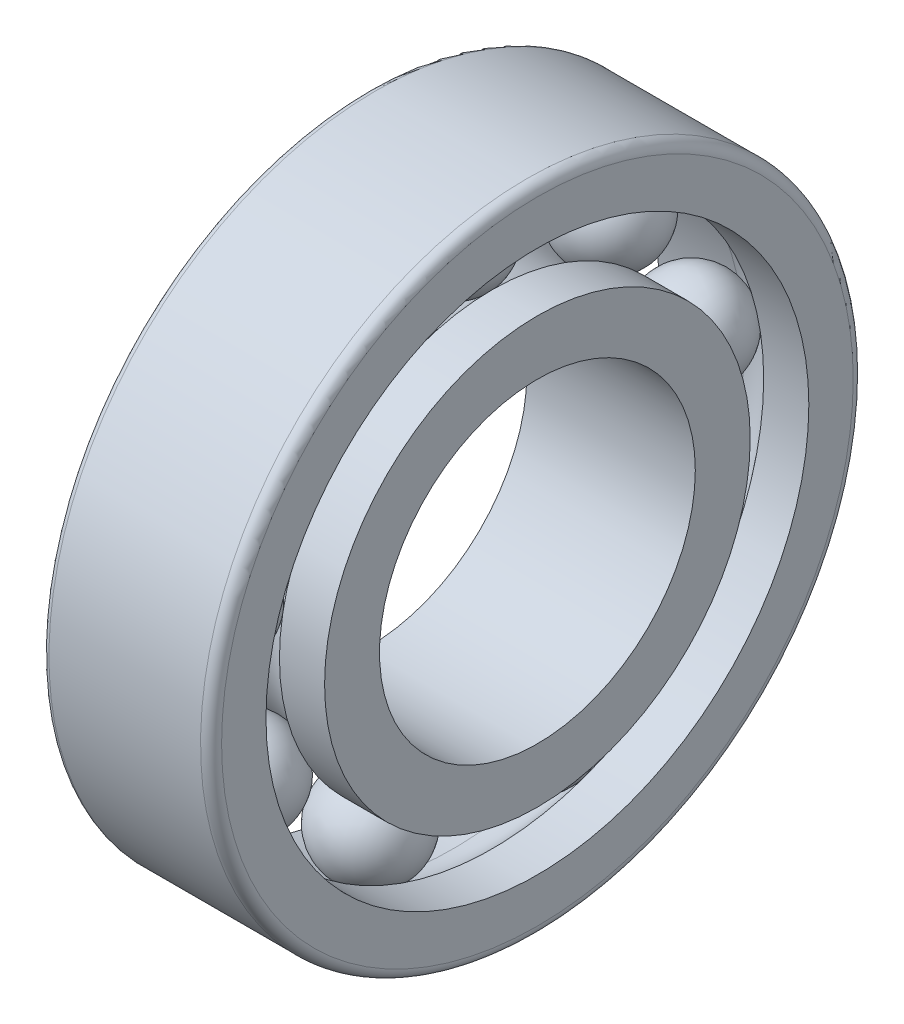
ISO-10303-21;
HEADER;
FILE_DESCRIPTION(('STEP AP214'),'2;1');
FILE_NAME('part.step','',(''),(''),'','','');
FILE_SCHEMA(('AUTOMOTIVE_DESIGN { 1 0 10303 214 1 1 1 1 }'));
ENDSEC;
DATA;
#1=APPLICATION_CONTEXT('core data for automotive mechanical design processes');
#2=APPLICATION_PROTOCOL_DEFINITION('international standard','automotive_design',2000,#1);
#3=PRODUCT_CONTEXT('',#1,'mechanical');
#4=PRODUCT('Part','Part','',(#3));
#5=PRODUCT_RELATED_PRODUCT_CATEGORY('part','',(#4));
#6=PRODUCT_DEFINITION_FORMATION('','',#4);
#7=PRODUCT_DEFINITION_CONTEXT('part definition',#1,'design');
#8=PRODUCT_DEFINITION('design','',#6,#7);
#9=PRODUCT_DEFINITION_SHAPE('','',#8);
#10=(LENGTH_UNIT() NAMED_UNIT(*) SI_UNIT(.MILLI.,.METRE.));
#11=(NAMED_UNIT(*) PLANE_ANGLE_UNIT() SI_UNIT($,.RADIAN.));
#12=(NAMED_UNIT(*) SI_UNIT($,.STERADIAN.) SOLID_ANGLE_UNIT());
#13=UNCERTAINTY_MEASURE_WITH_UNIT(LENGTH_MEASURE(1.E-05),#10,'distance_accuracy_value','');
#14=(GEOMETRIC_REPRESENTATION_CONTEXT(3) GLOBAL_UNCERTAINTY_ASSIGNED_CONTEXT((#13)) GLOBAL_UNIT_ASSIGNED_CONTEXT((#10,
#11,#12)) REPRESENTATION_CONTEXT('',''));
#15=CARTESIAN_POINT('',(0.,0.,0.));
#16=DIRECTION('',(0.,0.,1.));
#17=DIRECTION('',(1.,0.,0.));
#18=AXIS2_PLACEMENT_3D('',#15,#16,#17);
#19=CARTESIAN_POINT('',(8.,-11.5,19.9185842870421));
#20=DIRECTION('',(1.,0.,0.));
#21=DIRECTION('',(0.,-0.5,0.866025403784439));
#22=AXIS2_PLACEMENT_3D('',#19,#20,#21);
#23=SPHERICAL_SURFACE('',#22,4.64);
#24=CARTESIAN_POINT('',(3.36,-11.5,19.9185842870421));
#25=VERTEX_POINT('',#24);
#26=VERTEX_LOOP('',#25);
#27=FACE_BOUND('',#26,.T.);
#28=CARTESIAN_POINT('',(12.64,-11.5,19.9185842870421));
#29=VERTEX_POINT('',#28);
#30=VERTEX_LOOP('',#29);
#31=FACE_BOUND('',#30,.T.);
#32=ADVANCED_FACE('P0_F15',(#27,#31),#23,.T.);
#33=OPEN_SHELL('',(#32));
#34=SHELL_BASED_SURFACE_MODEL('P0_B1',(#33));
#35=CARTESIAN_POINT('',(8.,0.,0.));
#36=DIRECTION('',(1.,0.,0.));
#37=DIRECTION('',(0.,1.,0.));
#38=AXIS2_PLACEMENT_3D('',#35,#36,#37);
#39=TOROIDAL_SURFACE('',#38,23.,4.64);
#40=CARTESIAN_POINT('',(8.,0.,0.));
#41=DIRECTION('',(1.,0.,0.));
#42=DIRECTION('',(0.,0.,-1.));
#43=AXIS2_PLACEMENT_3D('',#40,#41,#42);
#44=CIRCLE('',#43,27.64);
#45=CARTESIAN_POINT('',(8.,0.,-27.64));
#46=VERTEX_POINT('',#45);
#47=EDGE_CURVE('P1_E112',#46,#46,#44,.T.);
#48=ORIENTED_EDGE('',*,*,#47,.F.);
#49=EDGE_LOOP('',(#48));
#50=FACE_BOUND('',#49,.T.);
#51=CARTESIAN_POINT('',(11.712,0.,0.));
#52=DIRECTION('',(1.,0.,0.));
#53=DIRECTION('',(0.,0.,-1.));
#54=AXIS2_PLACEMENT_3D('',#51,#52,#53);
#55=CIRCLE('',#54,25.784);
#56=CARTESIAN_POINT('',(11.712,0.,-25.784));
#57=VERTEX_POINT('',#56);
#58=EDGE_CURVE('P1_E115',#57,#57,#55,.F.);
#59=ORIENTED_EDGE('',*,*,#58,.F.);
#60=EDGE_LOOP('',(#59));
#61=FACE_BOUND('',#60,.T.);
#62=ADVANCED_FACE('P1_F14',(#50,#61),#39,.F.);
#63=CARTESIAN_POINT('',(13.856,0.,0.));
#64=DIRECTION('',(1.,0.,0.));
#65=DIRECTION('',(0.,0.,-1.));
#66=AXIS2_PLACEMENT_3D('',#63,#64,#65);
#67=CYLINDRICAL_SURFACE('',#66,25.784);
#68=CARTESIAN_POINT('',(16.,0.,0.));
#69=DIRECTION('',(1.,0.,0.));
#70=DIRECTION('',(0.,0.,-1.));
#71=AXIS2_PLACEMENT_3D('',#68,#69,#70);
#72=CIRCLE('',#71,25.784);
#73=CARTESIAN_POINT('',(16.,0.,-25.784));
#74=VERTEX_POINT('',#73);
#75=EDGE_CURVE('P1_E18',#74,#74,#72,.F.);
#76=ORIENTED_EDGE('',*,*,#75,.F.);
#77=EDGE_LOOP('',(#76));
#78=FACE_BOUND('',#77,.T.);
#79=ORIENTED_EDGE('',*,*,#58,.T.);
#80=EDGE_LOOP('',(#79));
#81=FACE_BOUND('',#80,.T.);
#82=ADVANCED_FACE('P1_F84',(#78,#81),#67,.F.);
#83=CARTESIAN_POINT('',(4.,0.,0.));
#84=DIRECTION('',(1.,0.,0.));
#85=DIRECTION('',(0.,0.,-1.));
#86=AXIS2_PLACEMENT_3D('',#83,#84,#85);
#87=CYLINDRICAL_SURFACE('',#86,27.64);
#88=ORIENTED_EDGE('',*,*,#47,.T.);
#89=EDGE_LOOP('',(#88));
#90=FACE_BOUND('',#89,.T.);
#91=CARTESIAN_POINT('',(0.,0.,0.));
#92=DIRECTION('',(1.,0.,0.));
#93=DIRECTION('',(0.,0.,-1.));
#94=AXIS2_PLACEMENT_3D('',#91,#92,#93);
#95=CIRCLE('',#94,27.64);
#96=CARTESIAN_POINT('',(0.,0.,-27.64));
#97=VERTEX_POINT('',#96);
#98=EDGE_CURVE('P1_E107',#97,#97,#95,.T.);
#99=ORIENTED_EDGE('',*,*,#98,.F.);
#100=EDGE_LOOP('',(#99));
#101=FACE_BOUND('',#100,.T.);
#102=ADVANCED_FACE('P1_F81',(#90,#101),#87,.F.);
#103=CARTESIAN_POINT('',(16.,28.392,0.));
#104=DIRECTION('',(1.,0.,0.));
#105=DIRECTION('',(0.,0.,-1.));
#106=AXIS2_PLACEMENT_3D('',#103,#104,#105);
#107=PLANE('',#106);
#108=CARTESIAN_POINT('',(16.,0.,0.));
#109=DIRECTION('',(-1.,0.,0.));
#110=DIRECTION('',(0.,1.,0.));
#111=AXIS2_PLACEMENT_3D('',#108,#109,#110);
#112=CIRCLE('',#111,30.);
#113=CARTESIAN_POINT('',(16.,30.,0.));
#114=VERTEX_POINT('',#113);
#115=EDGE_CURVE('P1_E65',#114,#114,#112,.T.);
#116=ORIENTED_EDGE('',*,*,#115,.F.);
#117=EDGE_LOOP('',(#116));
#118=FACE_BOUND('',#117,.T.);
#119=ORIENTED_EDGE('',*,*,#75,.T.);
#120=EDGE_LOOP('',(#119));
#121=FACE_BOUND('',#120,.T.);
#122=ADVANCED_FACE('P1_F71',(#118,#121),#107,.T.);
#123=CARTESIAN_POINT('',(0.,29.32,0.));
#124=DIRECTION('',(-1.,0.,0.));
#125=DIRECTION('',(0.,0.,1.));
#126=AXIS2_PLACEMENT_3D('',#123,#124,#125);
#127=PLANE('',#126);
#128=CARTESIAN_POINT('',(0.,0.,0.));
#129=DIRECTION('',(1.,0.,0.));
#130=DIRECTION('',(0.,1.,0.));
#131=AXIS2_PLACEMENT_3D('',#128,#129,#130);
#132=CIRCLE('',#131,30.4);
#133=CARTESIAN_POINT('',(0.,30.4,0.));
#134=VERTEX_POINT('',#133);
#135=EDGE_CURVE('P1_E27',#134,#134,#132,.T.);
#136=ORIENTED_EDGE('',*,*,#135,.F.);
#137=EDGE_LOOP('',(#136));
#138=FACE_BOUND('',#137,.T.);
#139=ORIENTED_EDGE('',*,*,#98,.T.);
#140=EDGE_LOOP('',(#139));
#141=FACE_BOUND('',#140,.T.);
#142=ADVANCED_FACE('P1_F80',(#138,#141),#127,.T.);
#143=CARTESIAN_POINT('',(15.,0.,0.));
#144=DIRECTION('',(1.,0.,0.));
#145=DIRECTION('',(0.,1.,0.));
#146=AXIS2_PLACEMENT_3D('',#143,#144,#145);
#147=TOROIDAL_SURFACE('',#146,30.,1.);
#148=ORIENTED_EDGE('',*,*,#115,.T.);
#149=EDGE_LOOP('',(#148));
#150=FACE_BOUND('',#149,.T.);
#151=CARTESIAN_POINT('',(15.,0.,0.));
#152=DIRECTION('',(1.,0.,0.));
#153=DIRECTION('',(0.,0.,-1.));
#154=AXIS2_PLACEMENT_3D('',#151,#152,#153);
#155=CIRCLE('',#154,31.);
#156=CARTESIAN_POINT('',(15.,0.,-31.));
#157=VERTEX_POINT('',#156);
#158=EDGE_CURVE('P1_E22',#157,#157,#155,.F.);
#159=ORIENTED_EDGE('',*,*,#158,.F.);
#160=EDGE_LOOP('',(#159));
#161=FACE_BOUND('',#160,.T.);
#162=ADVANCED_FACE('P1_F45',(#150,#161),#147,.T.);
#163=CARTESIAN_POINT('',(0.600000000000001,0.,0.));
#164=DIRECTION('',(1.,0.,0.));
#165=DIRECTION('',(0.,1.,0.));
#166=AXIS2_PLACEMENT_3D('',#163,#164,#165);
#167=TOROIDAL_SURFACE('',#166,30.4,0.6);
#168=CARTESIAN_POINT('',(0.600000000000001,0.,0.));
#169=DIRECTION('',(1.,0.,0.));
#170=DIRECTION('',(0.,0.,-1.));
#171=AXIS2_PLACEMENT_3D('',#168,#169,#170);
#172=CIRCLE('',#171,31.);
#173=CARTESIAN_POINT('',(0.600000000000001,0.,-31.));
#174=VERTEX_POINT('',#173);
#175=EDGE_CURVE('P1_E10',#174,#174,#172,.T.);
#176=ORIENTED_EDGE('',*,*,#175,.F.);
#177=EDGE_LOOP('',(#176));
#178=FACE_BOUND('',#177,.T.);
#179=ORIENTED_EDGE('',*,*,#135,.T.);
#180=EDGE_LOOP('',(#179));
#181=FACE_BOUND('',#180,.T.);
#182=ADVANCED_FACE('P1_F39',(#178,#181),#167,.T.);
#183=CARTESIAN_POINT('',(8.,0.,0.));
#184=DIRECTION('',(1.,0.,0.));
#185=DIRECTION('',(0.,0.,-1.));
#186=AXIS2_PLACEMENT_3D('',#183,#184,#185);
#187=CYLINDRICAL_SURFACE('',#186,31.);
#188=ORIENTED_EDGE('',*,*,#175,.T.);
#189=EDGE_LOOP('',(#188));
#190=FACE_BOUND('',#189,.T.);
#191=ORIENTED_EDGE('',*,*,#158,.T.);
#192=EDGE_LOOP('',(#191));
#193=FACE_BOUND('',#192,.T.);
#194=ADVANCED_FACE('P1_F44',(#190,#193),#187,.T.);
#195=CLOSED_SHELL('',(#62,#82,#102,#122,#142,#162,#182,#194));
#196=MANIFOLD_SOLID_BREP('P1_B1',#195);
#197=CARTESIAN_POINT('',(8.,17.6190221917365,-14.7841150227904));
#198=DIRECTION('',(1.,0.,0.));
#199=DIRECTION('',(0.,0.766044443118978,-0.64278760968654));
#200=AXIS2_PLACEMENT_3D('',#197,#198,#199);
#201=SPHERICAL_SURFACE('',#200,4.64);
#202=CARTESIAN_POINT('',(3.36,17.6190221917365,-14.7841150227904));
#203=VERTEX_POINT('',#202);
#204=VERTEX_LOOP('',#203);
#205=FACE_BOUND('',#204,.T.);
#206=CARTESIAN_POINT('',(12.64,17.6190221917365,-14.7841150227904));
#207=VERTEX_POINT('',#206);
#208=VERTEX_LOOP('',#207);
#209=FACE_BOUND('',#208,.T.);
#210=ADVANCED_FACE('P2_F15',(#205,#209),#201,.T.);
#211=OPEN_SHELL('',(#210));
#212=SHELL_BASED_SURFACE_MODEL('P2_B1',(#211));
#213=CARTESIAN_POINT('',(8.,0.,0.));
#214=DIRECTION('',(1.,0.,0.));
#215=DIRECTION('',(0.,1.,0.));
#216=AXIS2_PLACEMENT_3D('',#213,#214,#215);
#217=TOROIDAL_SURFACE('',#216,23.,4.64);
#218=CARTESIAN_POINT('',(11.712,0.,0.));
#219=DIRECTION('',(1.,0.,0.));
#220=DIRECTION('',(0.,0.,-1.));
#221=AXIS2_PLACEMENT_3D('',#218,#219,#220);
#222=CIRCLE('',#221,20.216);
#223=CARTESIAN_POINT('',(11.712,0.,-20.216));
#224=VERTEX_POINT('',#223);
#225=EDGE_CURVE('P3_E35',#224,#224,#222,.T.);
#226=ORIENTED_EDGE('',*,*,#225,.F.);
#227=EDGE_LOOP('',(#226));
#228=FACE_BOUND('',#227,.T.);
#229=CARTESIAN_POINT('',(4.288,0.,0.));
#230=DIRECTION('',(1.,0.,0.));
#231=DIRECTION('',(0.,0.,-1.));
#232=AXIS2_PLACEMENT_3D('',#229,#230,#231);
#233=CIRCLE('',#232,20.216);
#234=CARTESIAN_POINT('',(4.288,0.,-20.216));
#235=VERTEX_POINT('',#234);
#236=EDGE_CURVE('P3_E39',#235,#235,#233,.F.);
#237=ORIENTED_EDGE('',*,*,#236,.F.);
#238=EDGE_LOOP('',(#237));
#239=FACE_BOUND('',#238,.T.);
#240=ADVANCED_FACE('P3_F14',(#228,#239),#217,.F.);
#241=CARTESIAN_POINT('',(2.144,0.,0.));
#242=DIRECTION('',(1.,0.,0.));
#243=DIRECTION('',(0.,0.,-1.));
#244=AXIS2_PLACEMENT_3D('',#241,#242,#243);
#245=CYLINDRICAL_SURFACE('',#244,20.216);
#246=CARTESIAN_POINT('',(0.,0.,0.));
#247=DIRECTION('',(1.,0.,0.));
#248=DIRECTION('',(0.,0.,-1.));
#249=AXIS2_PLACEMENT_3D('',#246,#247,#248);
#250=CIRCLE('',#249,20.216);
#251=CARTESIAN_POINT('',(0.,0.,-20.216));
#252=VERTEX_POINT('',#251);
#253=EDGE_CURVE('P3_E18',#252,#252,#250,.F.);
#254=ORIENTED_EDGE('',*,*,#253,.F.);
#255=EDGE_LOOP('',(#254));
#256=FACE_BOUND('',#255,.T.);
#257=ORIENTED_EDGE('',*,*,#236,.T.);
#258=EDGE_LOOP('',(#257));
#259=FACE_BOUND('',#258,.T.);
#260=ADVANCED_FACE('P3_F46',(#256,#259),#245,.T.);
#261=CARTESIAN_POINT('',(13.856,0.,0.));
#262=DIRECTION('',(1.,0.,0.));
#263=DIRECTION('',(0.,0.,-1.));
#264=AXIS2_PLACEMENT_3D('',#261,#262,#263);
#265=CYLINDRICAL_SURFACE('',#264,20.216);
#266=ORIENTED_EDGE('',*,*,#225,.T.);
#267=EDGE_LOOP('',(#266));
#268=FACE_BOUND('',#267,.T.);
#269=CARTESIAN_POINT('',(16.,0.,0.));
#270=DIRECTION('',(1.,0.,0.));
#271=DIRECTION('',(0.,0.,-1.));
#272=AXIS2_PLACEMENT_3D('',#269,#270,#271);
#273=CIRCLE('',#272,20.216);
#274=CARTESIAN_POINT('',(16.,0.,-20.216));
#275=VERTEX_POINT('',#274);
#276=EDGE_CURVE('P3_E27',#275,#275,#273,.T.);
#277=ORIENTED_EDGE('',*,*,#276,.F.);
#278=EDGE_LOOP('',(#277));
#279=FACE_BOUND('',#278,.T.);
#280=ADVANCED_FACE('P3_F54',(#268,#279),#265,.T.);
#281=CARTESIAN_POINT('',(0.,17.608,0.));
#282=DIRECTION('',(-1.,0.,0.));
#283=DIRECTION('',(0.,0.,1.));
#284=AXIS2_PLACEMENT_3D('',#281,#282,#283);
#285=PLANE('',#284);
#286=CARTESIAN_POINT('',(0.,0.,0.));
#287=DIRECTION('',(1.,0.,0.));
#288=DIRECTION('',(0.,0.,-1.));
#289=AXIS2_PLACEMENT_3D('',#286,#287,#288);
#290=CIRCLE('',#289,15.);
#291=CARTESIAN_POINT('',(0.,0.,-15.));
#292=VERTEX_POINT('',#291);
#293=EDGE_CURVE('P3_E22',#292,#292,#290,.F.);
#294=ORIENTED_EDGE('',*,*,#293,.F.);
#295=EDGE_LOOP('',(#294));
#296=FACE_BOUND('',#295,.T.);
#297=ORIENTED_EDGE('',*,*,#253,.T.);
#298=EDGE_LOOP('',(#297));
#299=FACE_BOUND('',#298,.T.);
#300=ADVANCED_FACE('P3_F63',(#296,#299),#285,.T.);
#301=CARTESIAN_POINT('',(16.,17.608,0.));
#302=DIRECTION('',(1.,0.,0.));
#303=DIRECTION('',(0.,0.,-1.));
#304=AXIS2_PLACEMENT_3D('',#301,#302,#303);
#305=PLANE('',#304);
#306=ORIENTED_EDGE('',*,*,#276,.T.);
#307=EDGE_LOOP('',(#306));
#308=FACE_BOUND('',#307,.T.);
#309=CARTESIAN_POINT('',(16.,0.,0.));
#310=DIRECTION('',(1.,0.,0.));
#311=DIRECTION('',(0.,0.,-1.));
#312=AXIS2_PLACEMENT_3D('',#309,#310,#311);
#313=CIRCLE('',#312,15.);
#314=CARTESIAN_POINT('',(16.,0.,-15.));
#315=VERTEX_POINT('',#314);
#316=EDGE_CURVE('P3_E10',#315,#315,#313,.T.);
#317=ORIENTED_EDGE('',*,*,#316,.F.);
#318=EDGE_LOOP('',(#317));
#319=FACE_BOUND('',#318,.T.);
#320=ADVANCED_FACE('P3_F58',(#308,#319),#305,.T.);
#321=CARTESIAN_POINT('',(8.,0.,0.));
#322=DIRECTION('',(1.,0.,0.));
#323=DIRECTION('',(0.,0.,-1.));
#324=AXIS2_PLACEMENT_3D('',#321,#322,#323);
#325=CYLINDRICAL_SURFACE('',#324,15.);
#326=ORIENTED_EDGE('',*,*,#316,.T.);
#327=EDGE_LOOP('',(#326));
#328=FACE_BOUND('',#327,.T.);
#329=ORIENTED_EDGE('',*,*,#293,.T.);
#330=EDGE_LOOP('',(#329));
#331=FACE_BOUND('',#330,.T.);
#332=ADVANCED_FACE('P3_F56',(#328,#331),#325,.F.);
#333=CLOSED_SHELL('',(#240,#260,#280,#300,#320,#332));
#334=MANIFOLD_SOLID_BREP('P3_B1',#333);
#335=CARTESIAN_POINT('',(8.,17.6190221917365,14.7841150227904));
#336=DIRECTION('',(1.,0.,0.));
#337=DIRECTION('',(0.,0.766044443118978,0.642787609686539));
#338=AXIS2_PLACEMENT_3D('',#335,#336,#337);
#339=SPHERICAL_SURFACE('',#338,4.64);
#340=CARTESIAN_POINT('',(3.36,17.6190221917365,14.7841150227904));
#341=VERTEX_POINT('',#340);
#342=VERTEX_LOOP('',#341);
#343=FACE_BOUND('',#342,.T.);
#344=CARTESIAN_POINT('',(12.64,17.6190221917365,14.7841150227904));
#345=VERTEX_POINT('',#344);
#346=VERTEX_LOOP('',#345);
#347=FACE_BOUND('',#346,.T.);
#348=ADVANCED_FACE('P4_F15',(#343,#347),#339,.T.);
#349=OPEN_SHELL('',(#348));
#350=SHELL_BASED_SURFACE_MODEL('P4_B1',(#349));
#351=CARTESIAN_POINT('',(8.,-21.6129302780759,-7.86646329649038));
#352=DIRECTION('',(1.,0.,0.));
#353=DIRECTION('',(0.,-0.939692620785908,-0.342020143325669));
#354=AXIS2_PLACEMENT_3D('',#351,#352,#353);
#355=SPHERICAL_SURFACE('',#354,4.64);
#356=CARTESIAN_POINT('',(3.36,-21.6129302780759,-7.86646329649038));
#357=VERTEX_POINT('',#356);
#358=VERTEX_LOOP('',#357);
#359=FACE_BOUND('',#358,.T.);
#360=CARTESIAN_POINT('',(12.64,-21.6129302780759,-7.86646329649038));
#361=VERTEX_POINT('',#360);
#362=VERTEX_LOOP('',#361);
#363=FACE_BOUND('',#362,.T.);
#364=ADVANCED_FACE('P5_F15',(#359,#363),#355,.T.);
#365=OPEN_SHELL('',(#364));
#366=SHELL_BASED_SURFACE_MODEL('P5_B1',(#365));
#367=CARTESIAN_POINT('',(8.,3.9939080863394,22.6505783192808));
#368=DIRECTION('',(1.,0.,0.));
#369=DIRECTION('',(0.,0.17364817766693,0.984807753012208));
#370=AXIS2_PLACEMENT_3D('',#367,#368,#369);
#371=SPHERICAL_SURFACE('',#370,4.64);
#372=CARTESIAN_POINT('',(3.36,3.9939080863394,22.6505783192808));
#373=VERTEX_POINT('',#372);
#374=VERTEX_LOOP('',#373);
#375=FACE_BOUND('',#374,.T.);
#376=CARTESIAN_POINT('',(12.64,3.9939080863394,22.6505783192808));
#377=VERTEX_POINT('',#376);
#378=VERTEX_LOOP('',#377);
#379=FACE_BOUND('',#378,.T.);
#380=ADVANCED_FACE('P6_F15',(#375,#379),#371,.T.);
#381=OPEN_SHELL('',(#380));
#382=SHELL_BASED_SURFACE_MODEL('P6_B1',(#381));
#383=CARTESIAN_POINT('',(8.,3.99390808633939,-22.6505783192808));
#384=DIRECTION('',(1.,0.,0.));
#385=DIRECTION('',(0.,0.17364817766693,-0.984807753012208));
#386=AXIS2_PLACEMENT_3D('',#383,#384,#385);
#387=SPHERICAL_SURFACE('',#386,4.64);
#388=CARTESIAN_POINT('',(3.36,3.99390808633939,-22.6505783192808));
#389=VERTEX_POINT('',#388);
#390=VERTEX_LOOP('',#389);
#391=FACE_BOUND('',#390,.T.);
#392=CARTESIAN_POINT('',(12.64,3.99390808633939,-22.6505783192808));
#393=VERTEX_POINT('',#392);
#394=VERTEX_LOOP('',#393);
#395=FACE_BOUND('',#394,.T.);
#396=ADVANCED_FACE('P7_F15',(#391,#395),#387,.T.);
#397=OPEN_SHELL('',(#396));
#398=SHELL_BASED_SURFACE_MODEL('P7_B1',(#397));
#399=CARTESIAN_POINT('',(8.,-21.6129302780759,7.86646329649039));
#400=DIRECTION('',(1.,0.,0.));
#401=DIRECTION('',(0.,-0.939692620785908,0.342020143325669));
#402=AXIS2_PLACEMENT_3D('',#399,#400,#401);
#403=SPHERICAL_SURFACE('',#402,4.64);
#404=CARTESIAN_POINT('',(3.36,-21.6129302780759,7.86646329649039));
#405=VERTEX_POINT('',#404);
#406=VERTEX_LOOP('',#405);
#407=FACE_BOUND('',#406,.T.);
#408=CARTESIAN_POINT('',(12.64,-21.6129302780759,7.86646329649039));
#409=VERTEX_POINT('',#408);
#410=VERTEX_LOOP('',#409);
#411=FACE_BOUND('',#410,.T.);
#412=ADVANCED_FACE('P8_F15',(#407,#411),#403,.T.);
#413=OPEN_SHELL('',(#412));
#414=SHELL_BASED_SURFACE_MODEL('P8_B1',(#413));
#415=CARTESIAN_POINT('',(8.,-11.5,-19.9185842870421));
#416=DIRECTION('',(1.,0.,0.));
#417=DIRECTION('',(0.,-0.5,-0.866025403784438));
#418=AXIS2_PLACEMENT_3D('',#415,#416,#417);
#419=SPHERICAL_SURFACE('',#418,4.64);
#420=CARTESIAN_POINT('',(3.36,-11.5,-19.9185842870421));
#421=VERTEX_POINT('',#420);
#422=VERTEX_LOOP('',#421);
#423=FACE_BOUND('',#422,.T.);
#424=CARTESIAN_POINT('',(12.64,-11.5,-19.9185842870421));
#425=VERTEX_POINT('',#424);
#426=VERTEX_LOOP('',#425);
#427=FACE_BOUND('',#426,.T.);
#428=ADVANCED_FACE('P9_F15',(#423,#427),#419,.T.);
#429=OPEN_SHELL('',(#428));
#430=SHELL_BASED_SURFACE_MODEL('P9_B1',(#429));
#431=CARTESIAN_POINT('',(8.,23.,0.));
#432=DIRECTION('',(1.,0.,0.));
#433=DIRECTION('',(0.,1.,0.));
#434=AXIS2_PLACEMENT_3D('',#431,#432,#433);
#435=SPHERICAL_SURFACE('',#434,4.64);
#436=CARTESIAN_POINT('',(3.36,23.,0.));
#437=VERTEX_POINT('',#436);
#438=VERTEX_LOOP('',#437);
#439=FACE_BOUND('',#438,.T.);
#440=CARTESIAN_POINT('',(12.64,23.,0.));
#441=VERTEX_POINT('',#440);
#442=VERTEX_LOOP('',#441);
#443=FACE_BOUND('',#442,.T.);
#444=ADVANCED_FACE('P10_F15',(#439,#443),#435,.T.);
#445=OPEN_SHELL('',(#444));
#446=SHELL_BASED_SURFACE_MODEL('P10_B1',(#445));
#447=ADVANCED_BREP_SHAPE_REPRESENTATION('',(#18,#196,#334),#14);
#448=MANIFOLD_SURFACE_SHAPE_REPRESENTATION('',(#18,#34,#212,#350,#366,#382,#398,#414,#430,#446),#14);
#449=SHAPE_REPRESENTATION('',(#18),#14);
#450=SHAPE_DEFINITION_REPRESENTATION(#9,#449);
#451=SHAPE_REPRESENTATION_RELATIONSHIP('','',#449,#447);
#452=SHAPE_REPRESENTATION_RELATIONSHIP('','',#449,#448);
ENDSEC;
END-ISO-10303-21;
